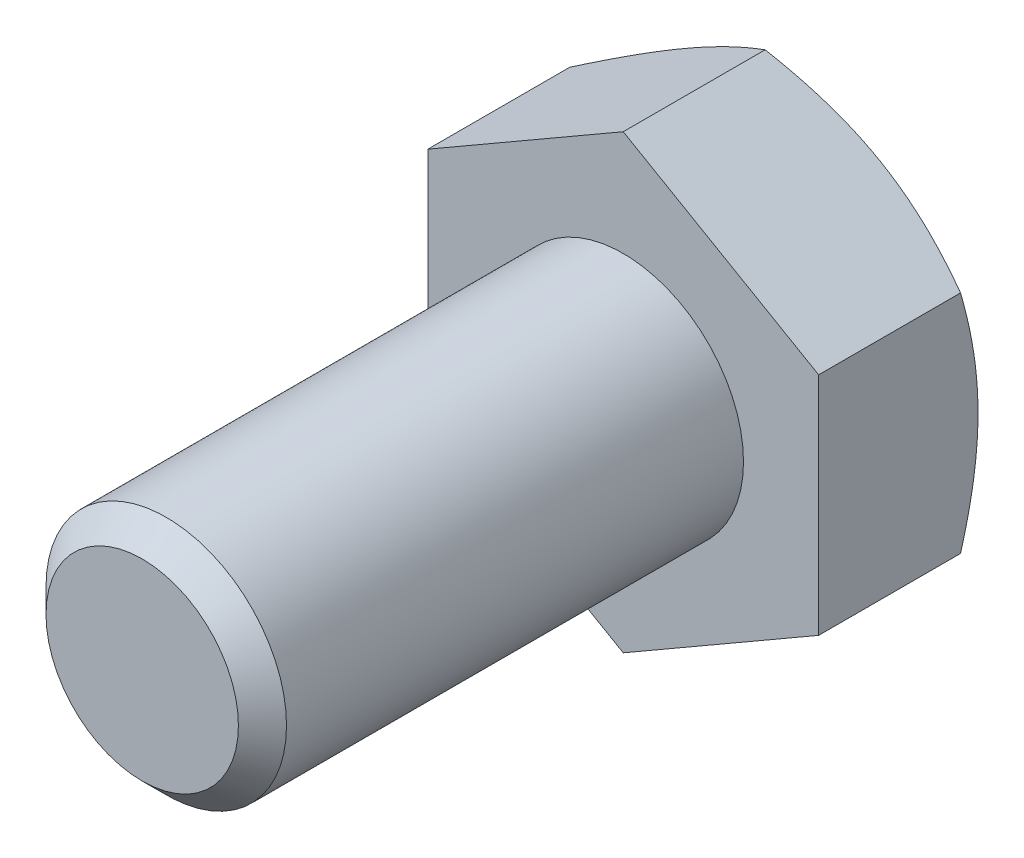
from build123d import *

# Parameters (mm, degrees)
ESQUISSE1_W        = 4
ESQUISSE1_H        = 16
CHANFREIN1_SIZE    = 0.8
BOSS_EXTRU_1_DEPTH = 5.3


with BuildPart() as part:
    # Esquisse1 → Base-R_volution (revolve)
    with BuildSketch(Plane(origin=(0, 0, 0), x_dir=(1, 0, 0), z_dir=(0, 1, 0))):
        with Locations((2, -8)):
            Rectangle(ESQUISSE1_W, ESQUISSE1_H)
    revolve(axis=Axis((0, 0, 0), (0, 0, 1)))

    # Chanfrein1
    chanfrein1_edges = [part.edges().sort_by_distance(p)[0] for p in [
        (-4, 0, 16),
    ]]
    chamfer(chanfrein1_edges, length=CHANFREIN1_SIZE)

    # Esquisse6 → Boss.-Extru.1 (add)
    with BuildSketch(Plane.XY):
        Polygon((6.5, -3.75277675), (6.5, 3.75277675), (0, 7.505553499), (-6.5, 3.75277675), (-6.5, -3.75277675), (0, -7.505553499), align=None)
    extrude(amount=-BOSS_EXTRU_1_DEPTH)

    # Esquisse7 → Enl_vement de mati_re-R_volution1 (revolve, cut)
    with BuildSketch(Plane(origin=(0, 0, 0), x_dir=(1, 0, 0), z_dir=(0, 1, 0))):
        Polygon((-6.5, 5.3), (-15.67986928, 5.3), (-15.67986928, 0), align=None)
    revolve(axis=Axis((0, 0, -6.239446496), (0, 0, 1)), mode=Mode.SUBTRACT)


solid = part.part
